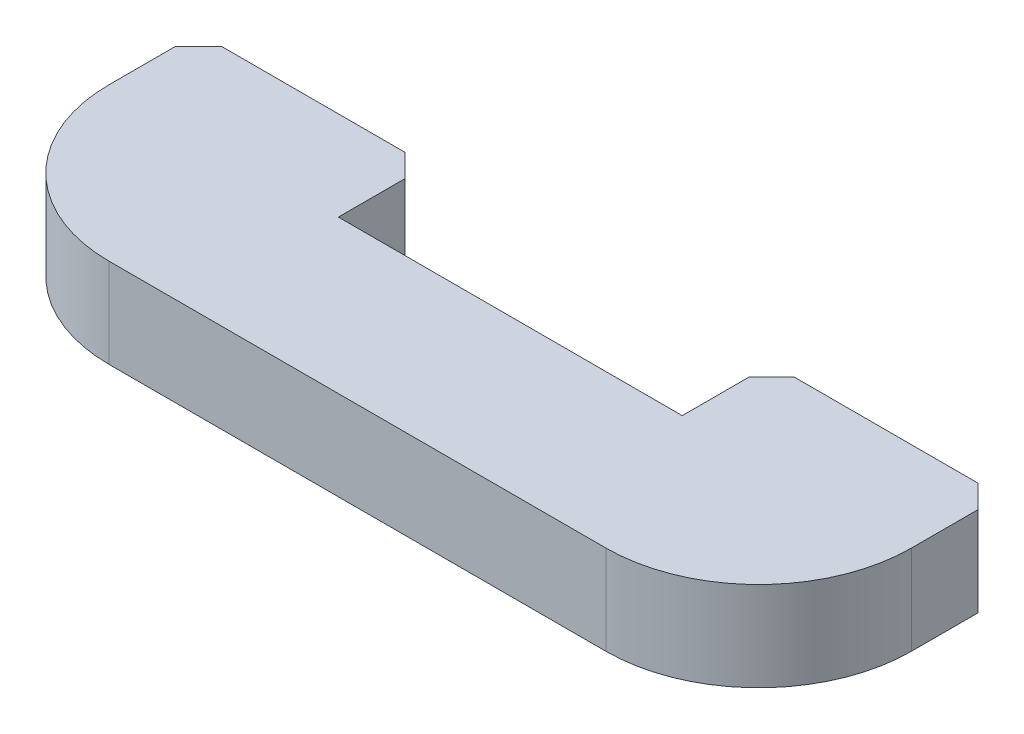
ISO-10303-21;
HEADER;
FILE_DESCRIPTION(('STEP AP214'),'2;1');
FILE_NAME('part.step','',(''),(''),'','','');
FILE_SCHEMA(('AUTOMOTIVE_DESIGN { 1 0 10303 214 1 1 1 1 }'));
ENDSEC;
DATA;
#1=APPLICATION_CONTEXT('core data for automotive mechanical design processes');
#2=APPLICATION_PROTOCOL_DEFINITION('international standard','automotive_design',2000,#1);
#3=PRODUCT_CONTEXT('',#1,'mechanical');
#4=PRODUCT('Part','Part','',(#3));
#5=PRODUCT_RELATED_PRODUCT_CATEGORY('part','',(#4));
#6=PRODUCT_DEFINITION_FORMATION('','',#4);
#7=PRODUCT_DEFINITION_CONTEXT('part definition',#1,'design');
#8=PRODUCT_DEFINITION('design','',#6,#7);
#9=PRODUCT_DEFINITION_SHAPE('','',#8);
#10=(LENGTH_UNIT() NAMED_UNIT(*) SI_UNIT(.MILLI.,.METRE.));
#11=(NAMED_UNIT(*) PLANE_ANGLE_UNIT() SI_UNIT($,.RADIAN.));
#12=(NAMED_UNIT(*) SI_UNIT($,.STERADIAN.) SOLID_ANGLE_UNIT());
#13=UNCERTAINTY_MEASURE_WITH_UNIT(LENGTH_MEASURE(1.E-05),#10,'distance_accuracy_value','');
#14=(GEOMETRIC_REPRESENTATION_CONTEXT(3) GLOBAL_UNCERTAINTY_ASSIGNED_CONTEXT((#13)) GLOBAL_UNIT_ASSIGNED_CONTEXT((#10,
#11,#12)) REPRESENTATION_CONTEXT('',''));
#15=CARTESIAN_POINT('',(0.,0.,0.));
#16=DIRECTION('',(0.,0.,1.));
#17=DIRECTION('',(1.,0.,0.));
#18=AXIS2_PLACEMENT_3D('',#15,#16,#17);
#19=CARTESIAN_POINT('',(-13.335,2.9718,-4.0259));
#20=DIRECTION('',(0.,0.,1.));
#21=DIRECTION('',(1.,0.,0.));
#22=AXIS2_PLACEMENT_3D('',#19,#20,#21);
#23=PLANE('',#22);
#24=DIRECTION('',(-1.,0.,0.));
#25=VECTOR('',#24,1.);
#26=CARTESIAN_POINT('',(-13.335,2.9718,-4.0259));
#27=LINE('',#26,#25);
#28=CARTESIAN_POINT('',(12.573,2.9718,-4.0259));
#29=VERTEX_POINT('',#28);
#30=CARTESIAN_POINT('',(6.47699999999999,2.9718,-4.0259));
#31=VERTEX_POINT('',#30);
#32=EDGE_CURVE('E197',#29,#31,#27,.T.);
#33=ORIENTED_EDGE('',*,*,#32,.F.);
#34=DIRECTION('',(0.,-1.,0.));
#35=VECTOR('',#34,1.);
#36=CARTESIAN_POINT('',(12.573,2.9718,-4.0259));
#37=LINE('',#36,#35);
#38=CARTESIAN_POINT('',(12.573,0.,-4.0259));
#39=VERTEX_POINT('',#38);
#40=EDGE_CURVE('E222',#29,#39,#37,.T.);
#41=ORIENTED_EDGE('',*,*,#40,.T.);
#42=DIRECTION('',(-1.,0.,0.));
#43=VECTOR('',#42,1.);
#44=CARTESIAN_POINT('',(-13.335,0.,-4.0259));
#45=LINE('',#44,#43);
#46=CARTESIAN_POINT('',(6.47699999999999,0.,-4.0259));
#47=VERTEX_POINT('',#46);
#48=EDGE_CURVE('E210',#39,#47,#45,.T.);
#49=ORIENTED_EDGE('',*,*,#48,.T.);
#50=DIRECTION('',(0.,1.,0.));
#51=VECTOR('',#50,1.);
#52=CARTESIAN_POINT('',(6.47699999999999,2.9718,-4.0259));
#53=LINE('',#52,#51);
#54=EDGE_CURVE('E218',#47,#31,#53,.T.);
#55=ORIENTED_EDGE('',*,*,#54,.T.);
#56=EDGE_LOOP('',(#33,#41,#49,#55));
#57=FACE_BOUND('',#56,.T.);
#58=ADVANCED_FACE('F43',(#57),#23,.F.);
#59=CARTESIAN_POINT('',(13.335,2.9718,-4.0259));
#60=DIRECTION('',(-1.,0.,0.));
#61=DIRECTION('',(0.,0.,1.));
#62=AXIS2_PLACEMENT_3D('',#59,#60,#61);
#63=PLANE('',#62);
#64=DIRECTION('',(0.,0.,-1.));
#65=VECTOR('',#64,1.);
#66=CARTESIAN_POINT('',(13.335,2.9718,-4.0259));
#67=LINE('',#66,#65);
#68=CARTESIAN_POINT('',(13.335,2.9718,-1.0541));
#69=VERTEX_POINT('',#68);
#70=CARTESIAN_POINT('',(13.335,2.9718,-3.2639));
#71=VERTEX_POINT('',#70);
#72=EDGE_CURVE('E189',#69,#71,#67,.T.);
#73=ORIENTED_EDGE('',*,*,#72,.F.);
#74=DIRECTION('',(0.,-1.,0.));
#75=VECTOR('',#74,1.);
#76=CARTESIAN_POINT('',(13.335,2.9718,-1.0541));
#77=LINE('',#76,#75);
#78=CARTESIAN_POINT('',(13.335,0.,-1.0541));
#79=VERTEX_POINT('',#78);
#80=EDGE_CURVE('E271',#69,#79,#77,.T.);
#81=ORIENTED_EDGE('',*,*,#80,.T.);
#82=DIRECTION('',(0.,0.,-1.));
#83=VECTOR('',#82,1.);
#84=CARTESIAN_POINT('',(13.335,0.,-4.0259));
#85=LINE('',#84,#83);
#86=CARTESIAN_POINT('',(13.335,0.,-3.2639));
#87=VERTEX_POINT('',#86);
#88=EDGE_CURVE('E160',#79,#87,#85,.T.);
#89=ORIENTED_EDGE('',*,*,#88,.T.);
#90=DIRECTION('',(0.,1.,0.));
#91=VECTOR('',#90,1.);
#92=CARTESIAN_POINT('',(13.335,2.9718,-3.2639));
#93=LINE('',#92,#91);
#94=EDGE_CURVE('E239',#87,#71,#93,.T.);
#95=ORIENTED_EDGE('',*,*,#94,.T.);
#96=EDGE_LOOP('',(#73,#81,#89,#95));
#97=FACE_BOUND('',#96,.T.);
#98=ADVANCED_FACE('F297',(#97),#63,.F.);
#99=CARTESIAN_POINT('',(-6.477,0.,-4.0259));
#100=VERTEX_POINT('',#99);
#101=CARTESIAN_POINT('',(-12.573,0.,-4.0259));
#102=VERTEX_POINT('',#101);
#103=EDGE_CURVE('E206',#100,#102,#45,.T.);
#104=ORIENTED_EDGE('',*,*,#103,.T.);
#105=DIRECTION('',(0.,1.,0.));
#106=VECTOR('',#105,1.);
#107=CARTESIAN_POINT('',(-12.573,2.9718,-4.0259));
#108=LINE('',#107,#106);
#109=CARTESIAN_POINT('',(-12.573,2.9718,-4.0259));
#110=VERTEX_POINT('',#109);
#111=EDGE_CURVE('E265',#102,#110,#108,.T.);
#112=ORIENTED_EDGE('',*,*,#111,.T.);
#113=CARTESIAN_POINT('',(-6.477,2.9718,-4.0259));
#114=VERTEX_POINT('',#113);
#115=EDGE_CURVE('E192',#114,#110,#27,.T.);
#116=ORIENTED_EDGE('',*,*,#115,.F.);
#117=DIRECTION('',(0.,-1.,0.));
#118=VECTOR('',#117,1.);
#119=CARTESIAN_POINT('',(-6.477,2.9718,-4.0259));
#120=LINE('',#119,#118);
#121=EDGE_CURVE('E261',#114,#100,#120,.T.);
#122=ORIENTED_EDGE('',*,*,#121,.T.);
#123=EDGE_LOOP('',(#104,#112,#116,#122));
#124=FACE_BOUND('',#123,.T.);
#125=ADVANCED_FACE('F315',(#124),#23,.F.);
#126=CARTESIAN_POINT('',(-13.335,2.9718,-4.0259));
#127=DIRECTION('',(1.,0.,0.));
#128=DIRECTION('',(0.,0.,-1.));
#129=AXIS2_PLACEMENT_3D('',#126,#127,#128);
#130=PLANE('',#129);
#131=DIRECTION('',(0.,0.,1.));
#132=VECTOR('',#131,1.);
#133=CARTESIAN_POINT('',(-13.335,0.,-4.0259));
#134=LINE('',#133,#132);
#135=CARTESIAN_POINT('',(-13.335,0.,-3.26389999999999));
#136=VERTEX_POINT('',#135);
#137=CARTESIAN_POINT('',(-13.335,0.,-1.0541));
#138=VERTEX_POINT('',#137);
#139=EDGE_CURVE('E211',#136,#138,#134,.T.);
#140=ORIENTED_EDGE('',*,*,#139,.T.);
#141=DIRECTION('',(0.,-1.,0.));
#142=VECTOR('',#141,1.);
#143=CARTESIAN_POINT('',(-13.335,2.9718,-1.0541));
#144=LINE('',#143,#142);
#145=CARTESIAN_POINT('',(-13.335,2.9718,-1.0541));
#146=VERTEX_POINT('',#145);
#147=EDGE_CURVE('E11',#138,#146,#144,.F.);
#148=ORIENTED_EDGE('',*,*,#147,.T.);
#149=DIRECTION('',(0.,0.,1.));
#150=VECTOR('',#149,1.);
#151=CARTESIAN_POINT('',(-13.335,2.9718,-4.0259));
#152=LINE('',#151,#150);
#153=CARTESIAN_POINT('',(-13.335,2.9718,-3.26389999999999));
#154=VERTEX_POINT('',#153);
#155=EDGE_CURVE('E198',#154,#146,#152,.T.);
#156=ORIENTED_EDGE('',*,*,#155,.F.);
#157=DIRECTION('',(0.,-1.,0.));
#158=VECTOR('',#157,1.);
#159=CARTESIAN_POINT('',(-13.335,2.9718,-3.26389999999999));
#160=LINE('',#159,#158);
#161=EDGE_CURVE('E257',#154,#136,#160,.T.);
#162=ORIENTED_EDGE('',*,*,#161,.T.);
#163=EDGE_LOOP('',(#140,#148,#156,#162));
#164=FACE_BOUND('',#163,.T.);
#165=ADVANCED_FACE('F307',(#164),#130,.F.);
#166=CARTESIAN_POINT('',(-13.335,2.9718,4.0259));
#167=DIRECTION('',(0.,0.,-1.));
#168=DIRECTION('',(-1.,0.,0.));
#169=AXIS2_PLACEMENT_3D('',#166,#167,#168);
#170=PLANE('',#169);
#171=DIRECTION('',(1.,0.,0.));
#172=VECTOR('',#171,1.);
#173=CARTESIAN_POINT('',(-13.335,0.,4.0259));
#174=LINE('',#173,#172);
#175=CARTESIAN_POINT('',(-8.25500000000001,0.,4.0259));
#176=VERTEX_POINT('',#175);
#177=CARTESIAN_POINT('',(8.255,0.,4.0259));
#178=VERTEX_POINT('',#177);
#179=EDGE_CURVE('E193',#176,#178,#174,.T.);
#180=ORIENTED_EDGE('',*,*,#179,.T.);
#181=DIRECTION('',(0.,-1.,0.));
#182=VECTOR('',#181,1.);
#183=CARTESIAN_POINT('',(8.255,2.9718,4.0259));
#184=LINE('',#183,#182);
#185=CARTESIAN_POINT('',(8.255,2.9718,4.0259));
#186=VERTEX_POINT('',#185);
#187=EDGE_CURVE('E65',#178,#186,#184,.F.);
#188=ORIENTED_EDGE('',*,*,#187,.T.);
#189=DIRECTION('',(1.,0.,0.));
#190=VECTOR('',#189,1.);
#191=CARTESIAN_POINT('',(-13.335,2.9718,4.0259));
#192=LINE('',#191,#190);
#193=CARTESIAN_POINT('',(-8.25500000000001,2.9718,4.0259));
#194=VERTEX_POINT('',#193);
#195=EDGE_CURVE('E201',#194,#186,#192,.T.);
#196=ORIENTED_EDGE('',*,*,#195,.F.);
#197=DIRECTION('',(0.,-1.,0.));
#198=VECTOR('',#197,1.);
#199=CARTESIAN_POINT('',(-8.25500000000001,2.9718,4.0259));
#200=LINE('',#199,#198);
#201=EDGE_CURVE('E281',#194,#176,#200,.T.);
#202=ORIENTED_EDGE('',*,*,#201,.T.);
#203=EDGE_LOOP('',(#180,#188,#196,#202));
#204=FACE_BOUND('',#203,.T.);
#205=ADVANCED_FACE('F302',(#204),#170,.F.);
#206=CARTESIAN_POINT('',(0.,2.9718,0.));
#207=DIRECTION('',(0.,1.,0.));
#208=DIRECTION('',(0.,0.,1.));
#209=AXIS2_PLACEMENT_3D('',#206,#207,#208);
#210=PLANE('',#209);
#211=ORIENTED_EDGE('',*,*,#195,.T.);
#212=CARTESIAN_POINT('',(8.255,2.9718,-1.0541));
#213=DIRECTION('',(0.,1.,0.));
#214=DIRECTION('',(0.,0.,1.));
#215=AXIS2_PLACEMENT_3D('',#212,#213,#214);
#216=CIRCLE('',#215,5.08);
#217=EDGE_CURVE('E52',#186,#69,#216,.T.);
#218=ORIENTED_EDGE('',*,*,#217,.T.);
#219=ORIENTED_EDGE('',*,*,#72,.T.);
#220=DIRECTION('',(0.707106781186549,0.,0.707106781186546));
#221=VECTOR('',#220,1.);
#222=CARTESIAN_POINT('',(8.29944999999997,2.9718,-8.29945000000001));
#223=LINE('',#222,#221);
#224=EDGE_CURVE('E252',#71,#29,#223,.F.);
#225=ORIENTED_EDGE('',*,*,#224,.T.);
#226=ORIENTED_EDGE('',*,*,#32,.T.);
#227=DIRECTION('',(0.707106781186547,0.,-0.707106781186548));
#228=VECTOR('',#227,1.);
#229=CARTESIAN_POINT('',(1.22555,2.9718,1.22555));
#230=LINE('',#229,#228);
#231=CARTESIAN_POINT('',(5.715,2.9718,-3.2639));
#232=VERTEX_POINT('',#231);
#233=EDGE_CURVE('E249',#31,#232,#230,.F.);
#234=ORIENTED_EDGE('',*,*,#233,.T.);
#235=DIRECTION('',(0.,0.,-1.));
#236=VECTOR('',#235,1.);
#237=CARTESIAN_POINT('',(5.715,2.9718,-6.9977));
#238=LINE('',#237,#236);
#239=CARTESIAN_POINT('',(5.715,2.9718,-1.0541));
#240=VERTEX_POINT('',#239);
#241=EDGE_CURVE('E181',#240,#232,#238,.T.);
#242=ORIENTED_EDGE('',*,*,#241,.F.);
#243=DIRECTION('',(1.,0.,0.));
#244=VECTOR('',#243,1.);
#245=CARTESIAN_POINT('',(-5.715,2.9718,-1.0541));
#246=LINE('',#245,#244);
#247=CARTESIAN_POINT('',(-5.715,2.9718,-1.0541));
#248=VERTEX_POINT('',#247);
#249=EDGE_CURVE('E155',#248,#240,#246,.T.);
#250=ORIENTED_EDGE('',*,*,#249,.F.);
#251=DIRECTION('',(0.,0.,1.));
#252=VECTOR('',#251,1.);
#253=CARTESIAN_POINT('',(-5.715,2.9718,-6.9977));
#254=LINE('',#253,#252);
#255=CARTESIAN_POINT('',(-5.715,2.9718,-3.2639));
#256=VERTEX_POINT('',#255);
#257=EDGE_CURVE('E184',#256,#248,#254,.T.);
#258=ORIENTED_EDGE('',*,*,#257,.F.);
#259=DIRECTION('',(0.707106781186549,0.,0.707106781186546));
#260=VECTOR('',#259,1.);
#261=CARTESIAN_POINT('',(-1.22554999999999,2.9718,1.22555));
#262=LINE('',#261,#260);
#263=EDGE_CURVE('E243',#256,#114,#262,.F.);
#264=ORIENTED_EDGE('',*,*,#263,.T.);
#265=ORIENTED_EDGE('',*,*,#115,.T.);
#266=DIRECTION('',(0.707106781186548,0.,-0.707106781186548));
#267=VECTOR('',#266,1.);
#268=CARTESIAN_POINT('',(-8.29945,2.9718,-8.29945));
#269=LINE('',#268,#267);
#270=EDGE_CURVE('E246',#110,#154,#269,.F.);
#271=ORIENTED_EDGE('',*,*,#270,.T.);
#272=ORIENTED_EDGE('',*,*,#155,.T.);
#273=CARTESIAN_POINT('',(-8.25500000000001,2.9718,-1.0541));
#274=DIRECTION('',(0.,1.,0.));
#275=DIRECTION('',(0.,0.,1.));
#276=AXIS2_PLACEMENT_3D('',#273,#274,#275);
#277=CIRCLE('',#276,5.08);
#278=EDGE_CURVE('E287',#146,#194,#277,.T.);
#279=ORIENTED_EDGE('',*,*,#278,.T.);
#280=EDGE_LOOP('',(#211,#218,#219,#225,#226,#234,#242,#250,#258,#264,#265,#271,#272,#279));
#281=FACE_BOUND('',#280,.T.);
#282=ADVANCED_FACE('F293',(#281),#210,.T.);
#283=CARTESIAN_POINT('',(0.,0.,0.));
#284=DIRECTION('',(0.,1.,0.));
#285=DIRECTION('',(0.,0.,1.));
#286=AXIS2_PLACEMENT_3D('',#283,#284,#285);
#287=PLANE('',#286);
#288=ORIENTED_EDGE('',*,*,#88,.F.);
#289=CARTESIAN_POINT('',(8.255,0.,-1.0541));
#290=DIRECTION('',(0.,1.,0.));
#291=DIRECTION('',(0.,0.,1.));
#292=AXIS2_PLACEMENT_3D('',#289,#290,#291);
#293=CIRCLE('',#292,5.08);
#294=EDGE_CURVE('E278',#79,#178,#293,.F.);
#295=ORIENTED_EDGE('',*,*,#294,.T.);
#296=ORIENTED_EDGE('',*,*,#179,.F.);
#297=CARTESIAN_POINT('',(-8.25500000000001,0.,-1.0541));
#298=DIRECTION('',(0.,1.,0.));
#299=DIRECTION('',(0.,0.,1.));
#300=AXIS2_PLACEMENT_3D('',#297,#298,#299);
#301=CIRCLE('',#300,5.08);
#302=EDGE_CURVE('E275',#176,#138,#301,.F.);
#303=ORIENTED_EDGE('',*,*,#302,.T.);
#304=ORIENTED_EDGE('',*,*,#139,.F.);
#305=DIRECTION('',(-0.707106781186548,0.,0.707106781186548));
#306=VECTOR('',#305,1.);
#307=CARTESIAN_POINT('',(-13.335,0.,-3.26389999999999));
#308=LINE('',#307,#306);
#309=EDGE_CURVE('E229',#136,#102,#308,.F.);
#310=ORIENTED_EDGE('',*,*,#309,.T.);
#311=ORIENTED_EDGE('',*,*,#103,.F.);
#312=DIRECTION('',(-0.707106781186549,0.,-0.707106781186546));
#313=VECTOR('',#312,1.);
#314=CARTESIAN_POINT('',(-6.477,0.,-4.0259));
#315=LINE('',#314,#313);
#316=CARTESIAN_POINT('',(-5.715,0.,-3.2639));
#317=VERTEX_POINT('',#316);
#318=EDGE_CURVE('E226',#100,#317,#315,.F.);
#319=ORIENTED_EDGE('',*,*,#318,.T.);
#320=DIRECTION('',(0.,0.,1.));
#321=VECTOR('',#320,1.);
#322=CARTESIAN_POINT('',(-5.715,0.,0.));
#323=LINE('',#322,#321);
#324=CARTESIAN_POINT('',(-5.715,0.,-1.0541));
#325=VERTEX_POINT('',#324);
#326=EDGE_CURVE('E175',#317,#325,#323,.T.);
#327=ORIENTED_EDGE('',*,*,#326,.T.);
#328=DIRECTION('',(1.,0.,0.));
#329=VECTOR('',#328,1.);
#330=CARTESIAN_POINT('',(-5.715,0.,-1.0541));
#331=LINE('',#330,#329);
#332=CARTESIAN_POINT('',(5.715,0.,-1.0541));
#333=VERTEX_POINT('',#332);
#334=EDGE_CURVE('E152',#325,#333,#331,.T.);
#335=ORIENTED_EDGE('',*,*,#334,.T.);
#336=DIRECTION('',(0.,0.,-1.));
#337=VECTOR('',#336,1.);
#338=CARTESIAN_POINT('',(5.715,0.,-6.9977));
#339=LINE('',#338,#337);
#340=CARTESIAN_POINT('',(5.715,0.,-3.2639));
#341=VERTEX_POINT('',#340);
#342=EDGE_CURVE('E164',#333,#341,#339,.T.);
#343=ORIENTED_EDGE('',*,*,#342,.T.);
#344=DIRECTION('',(-0.707106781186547,0.,0.707106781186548));
#345=VECTOR('',#344,1.);
#346=CARTESIAN_POINT('',(6.47699999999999,0.,-4.0259));
#347=LINE('',#346,#345);
#348=EDGE_CURVE('E232',#341,#47,#347,.F.);
#349=ORIENTED_EDGE('',*,*,#348,.T.);
#350=ORIENTED_EDGE('',*,*,#48,.F.);
#351=DIRECTION('',(-0.707106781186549,0.,-0.707106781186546));
#352=VECTOR('',#351,1.);
#353=CARTESIAN_POINT('',(12.573,0.,-4.0259));
#354=LINE('',#353,#352);
#355=EDGE_CURVE('E235',#39,#87,#354,.F.);
#356=ORIENTED_EDGE('',*,*,#355,.T.);
#357=EDGE_LOOP('',(#288,#295,#296,#303,#304,#310,#311,#319,#327,#335,#343,#349,#350,#356));
#358=FACE_BOUND('',#357,.T.);
#359=ADVANCED_FACE('F173',(#358),#287,.F.);
#360=CARTESIAN_POINT('',(5.715,0.,-6.9977));
#361=DIRECTION('',(1.,0.,0.));
#362=DIRECTION('',(0.,0.,-1.));
#363=AXIS2_PLACEMENT_3D('',#360,#361,#362);
#364=PLANE('',#363);
#365=ORIENTED_EDGE('',*,*,#241,.T.);
#366=DIRECTION('',(0.,-1.,0.));
#367=VECTOR('',#366,1.);
#368=CARTESIAN_POINT('',(5.715,0.,-3.2639));
#369=LINE('',#368,#367);
#370=EDGE_CURVE('E167',#232,#341,#369,.T.);
#371=ORIENTED_EDGE('',*,*,#370,.T.);
#372=ORIENTED_EDGE('',*,*,#342,.F.);
#373=DIRECTION('',(0.,1.,0.));
#374=VECTOR('',#373,1.);
#375=CARTESIAN_POINT('',(5.715,0.,-1.0541));
#376=LINE('',#375,#374);
#377=EDGE_CURVE('E147',#333,#240,#376,.T.);
#378=ORIENTED_EDGE('',*,*,#377,.T.);
#379=EDGE_LOOP('',(#365,#371,#372,#378));
#380=FACE_BOUND('',#379,.T.);
#381=ADVANCED_FACE('F165',(#380),#364,.F.);
#382=CARTESIAN_POINT('',(-5.715,0.,-6.9977));
#383=DIRECTION('',(-1.,0.,0.));
#384=DIRECTION('',(0.,0.,1.));
#385=AXIS2_PLACEMENT_3D('',#382,#383,#384);
#386=PLANE('',#385);
#387=ORIENTED_EDGE('',*,*,#326,.F.);
#388=DIRECTION('',(0.,1.,0.));
#389=VECTOR('',#388,1.);
#390=CARTESIAN_POINT('',(-5.715,0.,-3.2639));
#391=LINE('',#390,#389);
#392=EDGE_CURVE('E268',#317,#256,#391,.T.);
#393=ORIENTED_EDGE('',*,*,#392,.T.);
#394=ORIENTED_EDGE('',*,*,#257,.T.);
#395=DIRECTION('',(0.,1.,0.));
#396=VECTOR('',#395,1.);
#397=CARTESIAN_POINT('',(-5.715,0.,-1.0541));
#398=LINE('',#397,#396);
#399=EDGE_CURVE('E161',#325,#248,#398,.T.);
#400=ORIENTED_EDGE('',*,*,#399,.F.);
#401=EDGE_LOOP('',(#387,#393,#394,#400));
#402=FACE_BOUND('',#401,.T.);
#403=ADVANCED_FACE('F323',(#402),#386,.F.);
#404=CARTESIAN_POINT('',(-5.715,0.,-1.0541));
#405=DIRECTION('',(0.,0.,1.));
#406=DIRECTION('',(1.,0.,0.));
#407=AXIS2_PLACEMENT_3D('',#404,#405,#406);
#408=PLANE('',#407);
#409=ORIENTED_EDGE('',*,*,#249,.T.);
#410=ORIENTED_EDGE('',*,*,#377,.F.);
#411=ORIENTED_EDGE('',*,*,#334,.F.);
#412=ORIENTED_EDGE('',*,*,#399,.T.);
#413=EDGE_LOOP('',(#409,#410,#411,#412));
#414=FACE_BOUND('',#413,.T.);
#415=ADVANCED_FACE('F149',(#414),#408,.F.);
#416=CARTESIAN_POINT('',(12.573,2.9718,-4.0259));
#417=DIRECTION('',(-0.707106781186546,0.,0.707106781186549));
#418=DIRECTION('',(0.,-1.,0.));
#419=AXIS2_PLACEMENT_3D('',#416,#417,#418);
#420=PLANE('',#419);
#421=ORIENTED_EDGE('',*,*,#224,.F.);
#422=ORIENTED_EDGE('',*,*,#94,.F.);
#423=ORIENTED_EDGE('',*,*,#355,.F.);
#424=ORIENTED_EDGE('',*,*,#40,.F.);
#425=EDGE_LOOP('',(#421,#422,#423,#424));
#426=FACE_BOUND('',#425,.T.);
#427=ADVANCED_FACE('F337',(#426),#420,.F.);
#428=CARTESIAN_POINT('',(6.47699999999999,2.9718,-4.0259));
#429=DIRECTION('',(0.707106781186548,0.,0.707106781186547));
#430=DIRECTION('',(0.,1.,0.));
#431=AXIS2_PLACEMENT_3D('',#428,#429,#430);
#432=PLANE('',#431);
#433=ORIENTED_EDGE('',*,*,#348,.F.);
#434=ORIENTED_EDGE('',*,*,#370,.F.);
#435=ORIENTED_EDGE('',*,*,#233,.F.);
#436=ORIENTED_EDGE('',*,*,#54,.F.);
#437=EDGE_LOOP('',(#433,#434,#435,#436));
#438=FACE_BOUND('',#437,.T.);
#439=ADVANCED_FACE('F327',(#438),#432,.F.);
#440=CARTESIAN_POINT('',(-13.335,2.9718,-3.26389999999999));
#441=DIRECTION('',(0.707106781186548,0.,0.707106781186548));
#442=DIRECTION('',(0.,-1.,0.));
#443=AXIS2_PLACEMENT_3D('',#440,#441,#442);
#444=PLANE('',#443);
#445=ORIENTED_EDGE('',*,*,#270,.F.);
#446=ORIENTED_EDGE('',*,*,#111,.F.);
#447=ORIENTED_EDGE('',*,*,#309,.F.);
#448=ORIENTED_EDGE('',*,*,#161,.F.);
#449=EDGE_LOOP('',(#445,#446,#447,#448));
#450=FACE_BOUND('',#449,.T.);
#451=ADVANCED_FACE('F311',(#450),#444,.F.);
#452=CARTESIAN_POINT('',(-6.477,2.9718,-4.0259));
#453=DIRECTION('',(-0.707106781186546,0.,0.707106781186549));
#454=DIRECTION('',(0.,-1.,0.));
#455=AXIS2_PLACEMENT_3D('',#452,#453,#454);
#456=PLANE('',#455);
#457=ORIENTED_EDGE('',*,*,#263,.F.);
#458=ORIENTED_EDGE('',*,*,#392,.F.);
#459=ORIENTED_EDGE('',*,*,#318,.F.);
#460=ORIENTED_EDGE('',*,*,#121,.F.);
#461=EDGE_LOOP('',(#457,#458,#459,#460));
#462=FACE_BOUND('',#461,.T.);
#463=ADVANCED_FACE('F320',(#462),#456,.F.);
#464=CARTESIAN_POINT('',(8.255,2.9718,-1.0541));
#465=DIRECTION('',(0.,-1.,0.));
#466=DIRECTION('',(0.,0.,-1.));
#467=AXIS2_PLACEMENT_3D('',#464,#465,#466);
#468=CYLINDRICAL_SURFACE('',#467,5.08);
#469=ORIENTED_EDGE('',*,*,#217,.F.);
#470=ORIENTED_EDGE('',*,*,#187,.F.);
#471=ORIENTED_EDGE('',*,*,#294,.F.);
#472=ORIENTED_EDGE('',*,*,#80,.F.);
#473=EDGE_LOOP('',(#469,#470,#471,#472));
#474=FACE_BOUND('',#473,.T.);
#475=ADVANCED_FACE('F300',(#474),#468,.T.);
#476=CARTESIAN_POINT('',(-8.25500000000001,2.9718,-1.0541));
#477=DIRECTION('',(0.,-1.,0.));
#478=DIRECTION('',(0.,0.,-1.));
#479=AXIS2_PLACEMENT_3D('',#476,#477,#478);
#480=CYLINDRICAL_SURFACE('',#479,5.08);
#481=ORIENTED_EDGE('',*,*,#278,.F.);
#482=ORIENTED_EDGE('',*,*,#147,.F.);
#483=ORIENTED_EDGE('',*,*,#302,.F.);
#484=ORIENTED_EDGE('',*,*,#201,.F.);
#485=EDGE_LOOP('',(#481,#482,#483,#484));
#486=FACE_BOUND('',#485,.T.);
#487=ADVANCED_FACE('F45',(#486),#480,.T.);
#488=CLOSED_SHELL('',(#58,#98,#125,#165,#205,#282,#359,#381,#403,#415,#427,#439,#451,#463,#475,#487));
#489=MANIFOLD_SOLID_BREP('B2',#488);
#490=ADVANCED_BREP_SHAPE_REPRESENTATION('',(#18,#489),#14);
#491=SHAPE_DEFINITION_REPRESENTATION(#9,#490);
ENDSEC;
END-ISO-10303-21;
